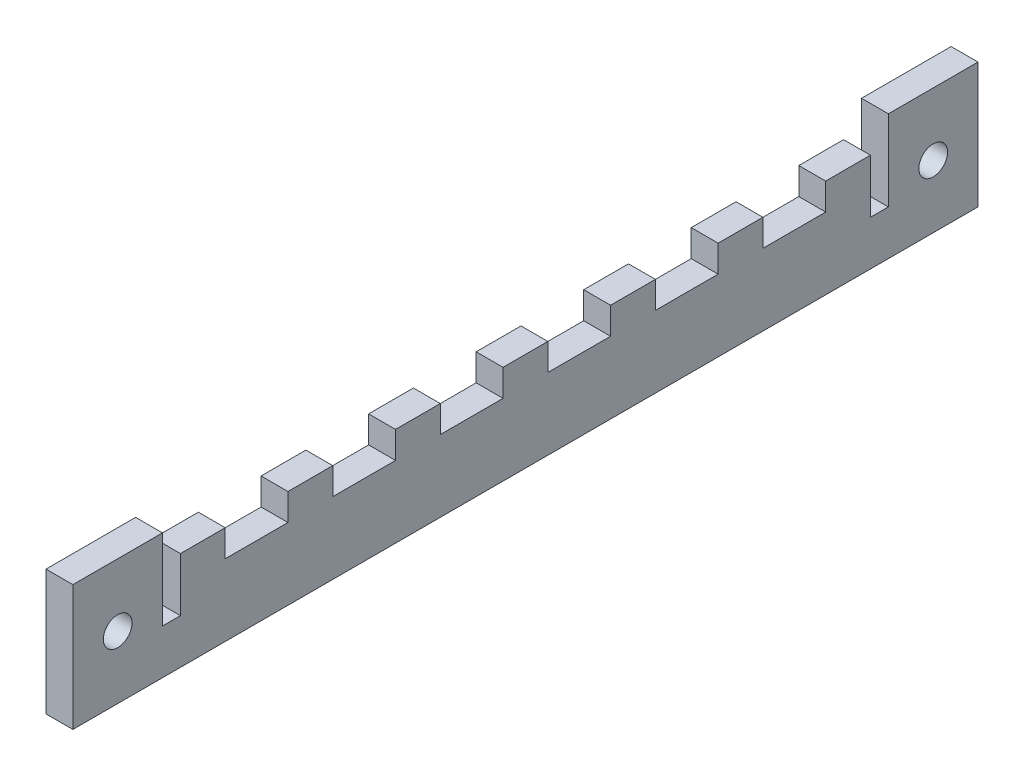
ISO-10303-21;
HEADER;
FILE_DESCRIPTION(('STEP AP214'),'2;1');
FILE_NAME('part.step','',(''),(''),'','','');
FILE_SCHEMA(('AUTOMOTIVE_DESIGN { 1 0 10303 214 1 1 1 1 }'));
ENDSEC;
DATA;
#1=APPLICATION_CONTEXT('core data for automotive mechanical design processes');
#2=APPLICATION_PROTOCOL_DEFINITION('international standard','automotive_design',2000,#1);
#3=PRODUCT_CONTEXT('',#1,'mechanical');
#4=PRODUCT('Part','Part','',(#3));
#5=PRODUCT_RELATED_PRODUCT_CATEGORY('part','',(#4));
#6=PRODUCT_DEFINITION_FORMATION('','',#4);
#7=PRODUCT_DEFINITION_CONTEXT('part definition',#1,'design');
#8=PRODUCT_DEFINITION('design','',#6,#7);
#9=PRODUCT_DEFINITION_SHAPE('','',#8);
#10=(LENGTH_UNIT() NAMED_UNIT(*) SI_UNIT(.MILLI.,.METRE.));
#11=(NAMED_UNIT(*) PLANE_ANGLE_UNIT() SI_UNIT($,.RADIAN.));
#12=(NAMED_UNIT(*) SI_UNIT($,.STERADIAN.) SOLID_ANGLE_UNIT());
#13=UNCERTAINTY_MEASURE_WITH_UNIT(LENGTH_MEASURE(1.E-05),#10,'distance_accuracy_value','');
#14=(GEOMETRIC_REPRESENTATION_CONTEXT(3) GLOBAL_UNCERTAINTY_ASSIGNED_CONTEXT((#13)) GLOBAL_UNIT_ASSIGNED_CONTEXT((#10,
#11,#12)) REPRESENTATION_CONTEXT('',''));
#15=CARTESIAN_POINT('',(0.,0.,0.));
#16=DIRECTION('',(0.,0.,1.));
#17=DIRECTION('',(1.,0.,0.));
#18=AXIS2_PLACEMENT_3D('',#15,#16,#17);
#19=CARTESIAN_POINT('',(25.5,24.4814087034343,-50.51));
#20=DIRECTION('',(-1.,0.,0.));
#21=DIRECTION('',(0.,0.,1.));
#22=AXIS2_PLACEMENT_3D('',#19,#20,#21);
#23=PLANE('',#22);
#24=CARTESIAN_POINT('',(25.5,7.,45.5));
#25=DIRECTION('',(-1.,0.,0.));
#26=DIRECTION('',(0.,0.,1.));
#27=AXIS2_PLACEMENT_3D('',#24,#25,#26);
#28=CIRCLE('',#27,1.6);
#29=CARTESIAN_POINT('',(25.5,7.,47.1));
#30=VERTEX_POINT('',#29);
#31=EDGE_CURVE('E282',#30,#30,#28,.F.);
#32=ORIENTED_EDGE('',*,*,#31,.F.);
#33=EDGE_LOOP('',(#32));
#34=FACE_BOUND('',#33,.T.);
#35=DIRECTION('',(0.,0.,-1.));
#36=VECTOR('',#35,1.);
#37=CARTESIAN_POINT('',(25.5,0.,0.));
#38=LINE('',#37,#36);
#39=CARTESIAN_POINT('',(25.5,0.,50.5));
#40=VERTEX_POINT('',#39);
#41=CARTESIAN_POINT('',(25.5,0.,-50.5));
#42=VERTEX_POINT('',#41);
#43=EDGE_CURVE('E302',#40,#42,#38,.T.);
#44=ORIENTED_EDGE('',*,*,#43,.T.);
#45=DIRECTION('',(0.,-1.,0.));
#46=VECTOR('',#45,1.);
#47=CARTESIAN_POINT('',(25.5,14.,-50.5));
#48=LINE('',#47,#46);
#49=CARTESIAN_POINT('',(25.5,14.,-50.5));
#50=VERTEX_POINT('',#49);
#51=EDGE_CURVE('E311',#50,#42,#48,.T.);
#52=ORIENTED_EDGE('',*,*,#51,.F.);
#53=DIRECTION('',(0.,0.,-1.));
#54=VECTOR('',#53,1.);
#55=CARTESIAN_POINT('',(25.5,14.,0.));
#56=LINE('',#55,#54);
#57=CARTESIAN_POINT('',(25.5,14.,-40.5));
#58=VERTEX_POINT('',#57);
#59=EDGE_CURVE('E307',#58,#50,#56,.T.);
#60=ORIENTED_EDGE('',*,*,#59,.F.);
#61=DIRECTION('',(0.,-1.,0.));
#62=VECTOR('',#61,1.);
#63=CARTESIAN_POINT('',(25.5,-4.,-40.5));
#64=LINE('',#63,#62);
#65=CARTESIAN_POINT('',(25.5,5.,-40.5));
#66=VERTEX_POINT('',#65);
#67=EDGE_CURVE('E275',#58,#66,#64,.T.);
#68=ORIENTED_EDGE('',*,*,#67,.T.);
#69=DIRECTION('',(0.,0.,-1.));
#70=VECTOR('',#69,1.);
#71=CARTESIAN_POINT('',(25.5,5.,-40.5));
#72=LINE('',#71,#70);
#73=CARTESIAN_POINT('',(25.5,5.,-38.5));
#74=VERTEX_POINT('',#73);
#75=EDGE_CURVE('E57',#74,#66,#72,.T.);
#76=ORIENTED_EDGE('',*,*,#75,.F.);
#77=DIRECTION('',(0.,-1.,0.));
#78=VECTOR('',#77,1.);
#79=CARTESIAN_POINT('',(25.5,11.,-38.5));
#80=LINE('',#79,#78);
#81=CARTESIAN_POINT('',(25.5,11.,-38.5));
#82=VERTEX_POINT('',#81);
#83=EDGE_CURVE('E583',#82,#74,#80,.T.);
#84=ORIENTED_EDGE('',*,*,#83,.F.);
#85=DIRECTION('',(0.,0.,1.));
#86=VECTOR('',#85,1.);
#87=CARTESIAN_POINT('',(25.5,11.,-38.5));
#88=LINE('',#87,#86);
#89=CARTESIAN_POINT('',(25.5,11.,-33.5));
#90=VERTEX_POINT('',#89);
#91=EDGE_CURVE('E329',#82,#90,#88,.T.);
#92=ORIENTED_EDGE('',*,*,#91,.T.);
#93=DIRECTION('',(0.,-1.,0.));
#94=VECTOR('',#93,1.);
#95=CARTESIAN_POINT('',(25.5,11.,-33.5));
#96=LINE('',#95,#94);
#97=CARTESIAN_POINT('',(25.5,8.,-33.5));
#98=VERTEX_POINT('',#97);
#99=EDGE_CURVE('E326',#90,#98,#96,.T.);
#100=ORIENTED_EDGE('',*,*,#99,.T.);
#101=DIRECTION('',(0.,0.,1.));
#102=VECTOR('',#101,1.);
#103=CARTESIAN_POINT('',(25.5,8.,-38.5));
#104=LINE('',#103,#102);
#105=CARTESIAN_POINT('',(25.5,8.,-26.5));
#106=VERTEX_POINT('',#105);
#107=EDGE_CURVE('E592',#98,#106,#104,.T.);
#108=ORIENTED_EDGE('',*,*,#107,.T.);
#109=DIRECTION('',(0.,-1.,0.));
#110=VECTOR('',#109,1.);
#111=CARTESIAN_POINT('',(25.5,11.,-26.5));
#112=LINE('',#111,#110);
#113=CARTESIAN_POINT('',(25.5,11.,-26.5));
#114=VERTEX_POINT('',#113);
#115=EDGE_CURVE('E577',#114,#106,#112,.T.);
#116=ORIENTED_EDGE('',*,*,#115,.F.);
#117=DIRECTION('',(0.,0.,1.));
#118=VECTOR('',#117,1.);
#119=CARTESIAN_POINT('',(25.5,11.,-26.5));
#120=LINE('',#119,#118);
#121=CARTESIAN_POINT('',(25.5,11.,-21.5));
#122=VERTEX_POINT('',#121);
#123=EDGE_CURVE('E333',#114,#122,#120,.T.);
#124=ORIENTED_EDGE('',*,*,#123,.T.);
#125=DIRECTION('',(0.,-1.,0.));
#126=VECTOR('',#125,1.);
#127=CARTESIAN_POINT('',(25.5,11.,-21.5));
#128=LINE('',#127,#126);
#129=CARTESIAN_POINT('',(25.5,8.,-21.5));
#130=VERTEX_POINT('',#129);
#131=EDGE_CURVE('E330',#122,#130,#128,.T.);
#132=ORIENTED_EDGE('',*,*,#131,.T.);
#133=CARTESIAN_POINT('',(25.5,8.,-14.5));
#134=VERTEX_POINT('',#133);
#135=EDGE_CURVE('E987',#130,#134,#104,.T.);
#136=ORIENTED_EDGE('',*,*,#135,.T.);
#137=DIRECTION('',(0.,-1.,0.));
#138=VECTOR('',#137,1.);
#139=CARTESIAN_POINT('',(25.5,11.,-14.5));
#140=LINE('',#139,#138);
#141=CARTESIAN_POINT('',(25.5,11.,-14.5));
#142=VERTEX_POINT('',#141);
#143=EDGE_CURVE('E571',#142,#134,#140,.T.);
#144=ORIENTED_EDGE('',*,*,#143,.F.);
#145=DIRECTION('',(0.,0.,1.));
#146=VECTOR('',#145,1.);
#147=CARTESIAN_POINT('',(25.5,11.,-14.5));
#148=LINE('',#147,#146);
#149=CARTESIAN_POINT('',(25.5,11.,-9.5));
#150=VERTEX_POINT('',#149);
#151=EDGE_CURVE('E337',#142,#150,#148,.T.);
#152=ORIENTED_EDGE('',*,*,#151,.T.);
#153=DIRECTION('',(0.,-1.,0.));
#154=VECTOR('',#153,1.);
#155=CARTESIAN_POINT('',(25.5,11.,-9.5));
#156=LINE('',#155,#154);
#157=CARTESIAN_POINT('',(25.5,8.,-9.5));
#158=VERTEX_POINT('',#157);
#159=EDGE_CURVE('E334',#150,#158,#156,.T.);
#160=ORIENTED_EDGE('',*,*,#159,.T.);
#161=CARTESIAN_POINT('',(25.5,8.,-2.49999999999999));
#162=VERTEX_POINT('',#161);
#163=EDGE_CURVE('E996',#158,#162,#104,.T.);
#164=ORIENTED_EDGE('',*,*,#163,.T.);
#165=DIRECTION('',(0.,-1.,0.));
#166=VECTOR('',#165,1.);
#167=CARTESIAN_POINT('',(25.5,11.,-2.49999999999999));
#168=LINE('',#167,#166);
#169=CARTESIAN_POINT('',(25.5,11.,-2.49999999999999));
#170=VERTEX_POINT('',#169);
#171=EDGE_CURVE('E565',#170,#162,#168,.T.);
#172=ORIENTED_EDGE('',*,*,#171,.F.);
#173=DIRECTION('',(0.,0.,1.));
#174=VECTOR('',#173,1.);
#175=CARTESIAN_POINT('',(25.5,11.,-2.49999999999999));
#176=LINE('',#175,#174);
#177=CARTESIAN_POINT('',(25.5,11.,2.5));
#178=VERTEX_POINT('',#177);
#179=EDGE_CURVE('E341',#170,#178,#176,.T.);
#180=ORIENTED_EDGE('',*,*,#179,.T.);
#181=DIRECTION('',(0.,-1.,0.));
#182=VECTOR('',#181,1.);
#183=CARTESIAN_POINT('',(25.5,11.,2.5));
#184=LINE('',#183,#182);
#185=CARTESIAN_POINT('',(25.5,8.,2.5));
#186=VERTEX_POINT('',#185);
#187=EDGE_CURVE('E338',#178,#186,#184,.T.);
#188=ORIENTED_EDGE('',*,*,#187,.T.);
#189=CARTESIAN_POINT('',(25.5,8.,9.50000000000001));
#190=VERTEX_POINT('',#189);
#191=EDGE_CURVE('E998',#186,#190,#104,.T.);
#192=ORIENTED_EDGE('',*,*,#191,.T.);
#193=DIRECTION('',(0.,-1.,0.));
#194=VECTOR('',#193,1.);
#195=CARTESIAN_POINT('',(25.5,11.,9.50000000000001));
#196=LINE('',#195,#194);
#197=CARTESIAN_POINT('',(25.5,11.,9.50000000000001));
#198=VERTEX_POINT('',#197);
#199=EDGE_CURVE('E559',#198,#190,#196,.T.);
#200=ORIENTED_EDGE('',*,*,#199,.F.);
#201=DIRECTION('',(0.,0.,1.));
#202=VECTOR('',#201,1.);
#203=CARTESIAN_POINT('',(25.5,11.,9.50000000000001));
#204=LINE('',#203,#202);
#205=CARTESIAN_POINT('',(25.5,11.,14.5));
#206=VERTEX_POINT('',#205);
#207=EDGE_CURVE('E345',#198,#206,#204,.T.);
#208=ORIENTED_EDGE('',*,*,#207,.T.);
#209=DIRECTION('',(0.,-1.,0.));
#210=VECTOR('',#209,1.);
#211=CARTESIAN_POINT('',(25.5,11.,14.5));
#212=LINE('',#211,#210);
#213=CARTESIAN_POINT('',(25.5,8.,14.5));
#214=VERTEX_POINT('',#213);
#215=EDGE_CURVE('E342',#206,#214,#212,.T.);
#216=ORIENTED_EDGE('',*,*,#215,.T.);
#217=CARTESIAN_POINT('',(25.5,8.,21.5));
#218=VERTEX_POINT('',#217);
#219=EDGE_CURVE('E591',#214,#218,#104,.T.);
#220=ORIENTED_EDGE('',*,*,#219,.T.);
#221=DIRECTION('',(0.,-1.,0.));
#222=VECTOR('',#221,1.);
#223=CARTESIAN_POINT('',(25.5,11.,21.5));
#224=LINE('',#223,#222);
#225=CARTESIAN_POINT('',(25.5,11.,21.5));
#226=VERTEX_POINT('',#225);
#227=EDGE_CURVE('E553',#226,#218,#224,.T.);
#228=ORIENTED_EDGE('',*,*,#227,.F.);
#229=DIRECTION('',(0.,0.,1.));
#230=VECTOR('',#229,1.);
#231=CARTESIAN_POINT('',(25.5,11.,21.5));
#232=LINE('',#231,#230);
#233=CARTESIAN_POINT('',(25.5,11.,26.5));
#234=VERTEX_POINT('',#233);
#235=EDGE_CURVE('E349',#226,#234,#232,.T.);
#236=ORIENTED_EDGE('',*,*,#235,.T.);
#237=DIRECTION('',(0.,-1.,0.));
#238=VECTOR('',#237,1.);
#239=CARTESIAN_POINT('',(25.5,11.,26.5));
#240=LINE('',#239,#238);
#241=CARTESIAN_POINT('',(25.5,8.,26.5));
#242=VERTEX_POINT('',#241);
#243=EDGE_CURVE('E346',#234,#242,#240,.T.);
#244=ORIENTED_EDGE('',*,*,#243,.T.);
#245=CARTESIAN_POINT('',(25.5,8.,33.5));
#246=VERTEX_POINT('',#245);
#247=EDGE_CURVE('E357',#242,#246,#104,.T.);
#248=ORIENTED_EDGE('',*,*,#247,.T.);
#249=DIRECTION('',(0.,-1.,0.));
#250=VECTOR('',#249,1.);
#251=CARTESIAN_POINT('',(25.5,11.,33.5));
#252=LINE('',#251,#250);
#253=CARTESIAN_POINT('',(25.5,11.,33.5));
#254=VERTEX_POINT('',#253);
#255=EDGE_CURVE('E548',#254,#246,#252,.T.);
#256=ORIENTED_EDGE('',*,*,#255,.F.);
#257=DIRECTION('',(0.,0.,1.));
#258=VECTOR('',#257,1.);
#259=CARTESIAN_POINT('',(25.5,11.,33.5));
#260=LINE('',#259,#258);
#261=CARTESIAN_POINT('',(25.5,11.,38.5));
#262=VERTEX_POINT('',#261);
#263=EDGE_CURVE('E352',#254,#262,#260,.T.);
#264=ORIENTED_EDGE('',*,*,#263,.T.);
#265=DIRECTION('',(0.,-1.,0.));
#266=VECTOR('',#265,1.);
#267=CARTESIAN_POINT('',(25.5,11.,38.5));
#268=LINE('',#267,#266);
#269=CARTESIAN_POINT('',(25.5,5.,38.5));
#270=VERTEX_POINT('',#269);
#271=EDGE_CURVE('E281',#262,#270,#268,.T.);
#272=ORIENTED_EDGE('',*,*,#271,.T.);
#273=CARTESIAN_POINT('',(25.5,5.,40.5));
#274=VERTEX_POINT('',#273);
#275=EDGE_CURVE('E49',#274,#270,#72,.T.);
#276=ORIENTED_EDGE('',*,*,#275,.F.);
#277=DIRECTION('',(0.,1.,0.));
#278=VECTOR('',#277,1.);
#279=CARTESIAN_POINT('',(25.5,-4.,40.5));
#280=LINE('',#279,#278);
#281=CARTESIAN_POINT('',(25.5,14.,40.5));
#282=VERTEX_POINT('',#281);
#283=EDGE_CURVE('E270',#274,#282,#280,.T.);
#284=ORIENTED_EDGE('',*,*,#283,.T.);
#285=CARTESIAN_POINT('',(25.5,14.,50.5));
#286=VERTEX_POINT('',#285);
#287=EDGE_CURVE('E305',#286,#282,#56,.T.);
#288=ORIENTED_EDGE('',*,*,#287,.F.);
#289=DIRECTION('',(0.,1.,0.));
#290=VECTOR('',#289,1.);
#291=CARTESIAN_POINT('',(25.5,14.,50.5));
#292=LINE('',#291,#290);
#293=EDGE_CURVE('E309',#40,#286,#292,.T.);
#294=ORIENTED_EDGE('',*,*,#293,.F.);
#295=EDGE_LOOP('',(#44,#52,#60,#68,#76,#84,#92,#100,#108,#116,#124,#132,#136,#144,#152,#160,
#164,#172,#180,#188,#192,#200,#208,#216,#220,#228,#236,#244,#248,#256,#264,#272,#276,#284,#288,#294));
#296=FACE_BOUND('',#295,.T.);
#297=CARTESIAN_POINT('',(25.5,7.,-45.5));
#298=DIRECTION('',(-1.,0.,0.));
#299=DIRECTION('',(0.,0.,1.));
#300=AXIS2_PLACEMENT_3D('',#297,#298,#299);
#301=CIRCLE('',#300,1.6);
#302=CARTESIAN_POINT('',(25.5,7.,-43.9));
#303=VERTEX_POINT('',#302);
#304=EDGE_CURVE('E314',#303,#303,#301,.F.);
#305=ORIENTED_EDGE('',*,*,#304,.F.);
#306=EDGE_LOOP('',(#305));
#307=FACE_BOUND('',#306,.T.);
#308=ADVANCED_FACE('F32',(#34,#296,#307),#23,.F.);
#309=CARTESIAN_POINT('',(22.5,24.4814087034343,-50.51));
#310=DIRECTION('',(-1.,0.,0.));
#311=DIRECTION('',(0.,0.,1.));
#312=AXIS2_PLACEMENT_3D('',#309,#310,#311);
#313=PLANE('',#312);
#314=CARTESIAN_POINT('',(22.5,7.,-45.5));
#315=DIRECTION('',(-1.,0.,0.));
#316=DIRECTION('',(0.,0.,1.));
#317=AXIS2_PLACEMENT_3D('',#314,#315,#316);
#318=CIRCLE('',#317,1.6);
#319=CARTESIAN_POINT('',(22.5,7.,-43.9));
#320=VERTEX_POINT('',#319);
#321=EDGE_CURVE('E293',#320,#320,#318,.F.);
#322=ORIENTED_EDGE('',*,*,#321,.T.);
#323=EDGE_LOOP('',(#322));
#324=FACE_BOUND('',#323,.T.);
#325=DIRECTION('',(0.,1.,0.));
#326=VECTOR('',#325,1.);
#327=CARTESIAN_POINT('',(22.5,14.,50.5));
#328=LINE('',#327,#326);
#329=CARTESIAN_POINT('',(22.5,0.,50.5));
#330=VERTEX_POINT('',#329);
#331=CARTESIAN_POINT('',(22.5,14.,50.5));
#332=VERTEX_POINT('',#331);
#333=EDGE_CURVE('E370',#330,#332,#328,.T.);
#334=ORIENTED_EDGE('',*,*,#333,.T.);
#335=DIRECTION('',(0.,0.,-1.));
#336=VECTOR('',#335,1.);
#337=CARTESIAN_POINT('',(22.5,14.,0.));
#338=LINE('',#337,#336);
#339=CARTESIAN_POINT('',(22.5,14.,40.5));
#340=VERTEX_POINT('',#339);
#341=EDGE_CURVE('E308',#332,#340,#338,.T.);
#342=ORIENTED_EDGE('',*,*,#341,.T.);
#343=DIRECTION('',(0.,1.,0.));
#344=VECTOR('',#343,1.);
#345=CARTESIAN_POINT('',(22.5,-4.,40.5));
#346=LINE('',#345,#344);
#347=CARTESIAN_POINT('',(22.5,5.,40.5));
#348=VERTEX_POINT('',#347);
#349=EDGE_CURVE('E540',#348,#340,#346,.T.);
#350=ORIENTED_EDGE('',*,*,#349,.F.);
#351=DIRECTION('',(0.,0.,-1.));
#352=VECTOR('',#351,1.);
#353=CARTESIAN_POINT('',(22.5,5.,-40.5));
#354=LINE('',#353,#352);
#355=CARTESIAN_POINT('',(22.5,5.,38.5));
#356=VERTEX_POINT('',#355);
#357=EDGE_CURVE('E287',#348,#356,#354,.T.);
#358=ORIENTED_EDGE('',*,*,#357,.T.);
#359=DIRECTION('',(0.,-1.,0.));
#360=VECTOR('',#359,1.);
#361=CARTESIAN_POINT('',(22.5,11.,38.5));
#362=LINE('',#361,#360);
#363=CARTESIAN_POINT('',(22.5,11.,38.5));
#364=VERTEX_POINT('',#363);
#365=EDGE_CURVE('E1017',#364,#356,#362,.T.);
#366=ORIENTED_EDGE('',*,*,#365,.F.);
#367=DIRECTION('',(0.,0.,1.));
#368=VECTOR('',#367,1.);
#369=CARTESIAN_POINT('',(22.5,11.,31.5));
#370=LINE('',#369,#368);
#371=CARTESIAN_POINT('',(22.5,11.,33.5));
#372=VERTEX_POINT('',#371);
#373=EDGE_CURVE('E1016',#372,#364,#370,.T.);
#374=ORIENTED_EDGE('',*,*,#373,.F.);
#375=DIRECTION('',(0.,1.,0.));
#376=VECTOR('',#375,1.);
#377=CARTESIAN_POINT('',(22.5,11.,33.5));
#378=LINE('',#377,#376);
#379=CARTESIAN_POINT('',(22.5,8.,33.5));
#380=VERTEX_POINT('',#379);
#381=EDGE_CURVE('E965',#380,#372,#378,.T.);
#382=ORIENTED_EDGE('',*,*,#381,.F.);
#383=DIRECTION('',(0.,0.,-1.));
#384=VECTOR('',#383,1.);
#385=CARTESIAN_POINT('',(22.5,8.,-38.5));
#386=LINE('',#385,#384);
#387=CARTESIAN_POINT('',(22.5,8.,26.5));
#388=VERTEX_POINT('',#387);
#389=EDGE_CURVE('E597',#380,#388,#386,.T.);
#390=ORIENTED_EDGE('',*,*,#389,.T.);
#391=DIRECTION('',(0.,-1.,0.));
#392=VECTOR('',#391,1.);
#393=CARTESIAN_POINT('',(22.5,11.,26.5));
#394=LINE('',#393,#392);
#395=CARTESIAN_POINT('',(22.5,11.,26.5));
#396=VERTEX_POINT('',#395);
#397=EDGE_CURVE('E960',#396,#388,#394,.T.);
#398=ORIENTED_EDGE('',*,*,#397,.F.);
#399=DIRECTION('',(0.,0.,1.));
#400=VECTOR('',#399,1.);
#401=CARTESIAN_POINT('',(22.5,11.,19.5));
#402=LINE('',#401,#400);
#403=CARTESIAN_POINT('',(22.5,11.,21.5));
#404=VERTEX_POINT('',#403);
#405=EDGE_CURVE('E1011',#404,#396,#402,.T.);
#406=ORIENTED_EDGE('',*,*,#405,.F.);
#407=DIRECTION('',(0.,1.,0.));
#408=VECTOR('',#407,1.);
#409=CARTESIAN_POINT('',(22.5,11.,21.5));
#410=LINE('',#409,#408);
#411=CARTESIAN_POINT('',(22.5,8.,21.5));
#412=VERTEX_POINT('',#411);
#413=EDGE_CURVE('E962',#412,#404,#410,.T.);
#414=ORIENTED_EDGE('',*,*,#413,.F.);
#415=CARTESIAN_POINT('',(22.5,8.,14.5));
#416=VERTEX_POINT('',#415);
#417=EDGE_CURVE('E966',#412,#416,#386,.T.);
#418=ORIENTED_EDGE('',*,*,#417,.T.);
#419=DIRECTION('',(0.,-1.,0.));
#420=VECTOR('',#419,1.);
#421=CARTESIAN_POINT('',(22.5,11.,14.5));
#422=LINE('',#421,#420);
#423=CARTESIAN_POINT('',(22.5,11.,14.5));
#424=VERTEX_POINT('',#423);
#425=EDGE_CURVE('E1026',#424,#416,#422,.T.);
#426=ORIENTED_EDGE('',*,*,#425,.F.);
#427=DIRECTION('',(0.,0.,1.));
#428=VECTOR('',#427,1.);
#429=CARTESIAN_POINT('',(22.5,11.,7.50000000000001));
#430=LINE('',#429,#428);
#431=CARTESIAN_POINT('',(22.5,11.,9.50000000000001));
#432=VERTEX_POINT('',#431);
#433=EDGE_CURVE('E1024',#432,#424,#430,.T.);
#434=ORIENTED_EDGE('',*,*,#433,.F.);
#435=DIRECTION('',(0.,1.,0.));
#436=VECTOR('',#435,1.);
#437=CARTESIAN_POINT('',(22.5,11.,9.50000000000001));
#438=LINE('',#437,#436);
#439=CARTESIAN_POINT('',(22.5,8.,9.50000000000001));
#440=VERTEX_POINT('',#439);
#441=EDGE_CURVE('E961',#440,#432,#438,.T.);
#442=ORIENTED_EDGE('',*,*,#441,.F.);
#443=CARTESIAN_POINT('',(22.5,8.,2.5));
#444=VERTEX_POINT('',#443);
#445=EDGE_CURVE('E968',#440,#444,#386,.T.);
#446=ORIENTED_EDGE('',*,*,#445,.T.);
#447=DIRECTION('',(0.,-1.,0.));
#448=VECTOR('',#447,1.);
#449=CARTESIAN_POINT('',(22.5,11.,2.5));
#450=LINE('',#449,#448);
#451=CARTESIAN_POINT('',(22.5,11.,2.5));
#452=VERTEX_POINT('',#451);
#453=EDGE_CURVE('E531',#452,#444,#450,.T.);
#454=ORIENTED_EDGE('',*,*,#453,.F.);
#455=DIRECTION('',(0.,0.,1.));
#456=VECTOR('',#455,1.);
#457=CARTESIAN_POINT('',(22.5,11.,-4.49999999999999));
#458=LINE('',#457,#456);
#459=CARTESIAN_POINT('',(22.5,11.,-2.49999999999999));
#460=VERTEX_POINT('',#459);
#461=EDGE_CURVE('E1030',#460,#452,#458,.T.);
#462=ORIENTED_EDGE('',*,*,#461,.F.);
#463=DIRECTION('',(0.,1.,0.));
#464=VECTOR('',#463,1.);
#465=CARTESIAN_POINT('',(22.5,11.,-2.49999999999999));
#466=LINE('',#465,#464);
#467=CARTESIAN_POINT('',(22.5,8.,-2.49999999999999));
#468=VERTEX_POINT('',#467);
#469=EDGE_CURVE('E1028',#468,#460,#466,.T.);
#470=ORIENTED_EDGE('',*,*,#469,.F.);
#471=CARTESIAN_POINT('',(22.5,8.,-9.5));
#472=VERTEX_POINT('',#471);
#473=EDGE_CURVE('E973',#468,#472,#386,.T.);
#474=ORIENTED_EDGE('',*,*,#473,.T.);
#475=DIRECTION('',(0.,-1.,0.));
#476=VECTOR('',#475,1.);
#477=CARTESIAN_POINT('',(22.5,11.,-9.5));
#478=LINE('',#477,#476);
#479=CARTESIAN_POINT('',(22.5,11.,-9.5));
#480=VERTEX_POINT('',#479);
#481=EDGE_CURVE('E530',#480,#472,#478,.T.);
#482=ORIENTED_EDGE('',*,*,#481,.F.);
#483=DIRECTION('',(0.,0.,1.));
#484=VECTOR('',#483,1.);
#485=CARTESIAN_POINT('',(22.5,11.,-16.5));
#486=LINE('',#485,#484);
#487=CARTESIAN_POINT('',(22.5,11.,-14.5));
#488=VERTEX_POINT('',#487);
#489=EDGE_CURVE('E525',#488,#480,#486,.T.);
#490=ORIENTED_EDGE('',*,*,#489,.F.);
#491=DIRECTION('',(0.,1.,0.));
#492=VECTOR('',#491,1.);
#493=CARTESIAN_POINT('',(22.5,11.,-14.5));
#494=LINE('',#493,#492);
#495=CARTESIAN_POINT('',(22.5,8.,-14.5));
#496=VERTEX_POINT('',#495);
#497=EDGE_CURVE('E527',#496,#488,#494,.T.);
#498=ORIENTED_EDGE('',*,*,#497,.F.);
#499=CARTESIAN_POINT('',(22.5,8.,-21.5));
#500=VERTEX_POINT('',#499);
#501=EDGE_CURVE('E596',#496,#500,#386,.T.);
#502=ORIENTED_EDGE('',*,*,#501,.T.);
#503=DIRECTION('',(0.,-1.,0.));
#504=VECTOR('',#503,1.);
#505=CARTESIAN_POINT('',(22.5,11.,-21.5));
#506=LINE('',#505,#504);
#507=CARTESIAN_POINT('',(22.5,11.,-21.5));
#508=VERTEX_POINT('',#507);
#509=EDGE_CURVE('E532',#508,#500,#506,.T.);
#510=ORIENTED_EDGE('',*,*,#509,.F.);
#511=DIRECTION('',(0.,0.,1.));
#512=VECTOR('',#511,1.);
#513=CARTESIAN_POINT('',(22.5,11.,-28.5));
#514=LINE('',#513,#512);
#515=CARTESIAN_POINT('',(22.5,11.,-26.5));
#516=VERTEX_POINT('',#515);
#517=EDGE_CURVE('E536',#516,#508,#514,.T.);
#518=ORIENTED_EDGE('',*,*,#517,.F.);
#519=DIRECTION('',(0.,1.,0.));
#520=VECTOR('',#519,1.);
#521=CARTESIAN_POINT('',(22.5,11.,-26.5));
#522=LINE('',#521,#520);
#523=CARTESIAN_POINT('',(22.5,8.,-26.5));
#524=VERTEX_POINT('',#523);
#525=EDGE_CURVE('E535',#524,#516,#522,.T.);
#526=ORIENTED_EDGE('',*,*,#525,.F.);
#527=CARTESIAN_POINT('',(22.5,8.,-33.5));
#528=VERTEX_POINT('',#527);
#529=EDGE_CURVE('E593',#524,#528,#386,.T.);
#530=ORIENTED_EDGE('',*,*,#529,.T.);
#531=DIRECTION('',(0.,-1.,0.));
#532=VECTOR('',#531,1.);
#533=CARTESIAN_POINT('',(22.5,11.,-33.5));
#534=LINE('',#533,#532);
#535=CARTESIAN_POINT('',(22.5,11.,-33.5));
#536=VERTEX_POINT('',#535);
#537=EDGE_CURVE('E534',#536,#528,#534,.T.);
#538=ORIENTED_EDGE('',*,*,#537,.F.);
#539=DIRECTION('',(0.,0.,1.));
#540=VECTOR('',#539,1.);
#541=CARTESIAN_POINT('',(22.5,11.,-40.5));
#542=LINE('',#541,#540);
#543=CARTESIAN_POINT('',(22.5,11.,-38.5));
#544=VERTEX_POINT('',#543);
#545=EDGE_CURVE('E366',#544,#536,#542,.T.);
#546=ORIENTED_EDGE('',*,*,#545,.F.);
#547=DIRECTION('',(0.,1.,0.));
#548=VECTOR('',#547,1.);
#549=CARTESIAN_POINT('',(22.5,11.,-38.5));
#550=LINE('',#549,#548);
#551=CARTESIAN_POINT('',(22.5,5.,-38.5));
#552=VERTEX_POINT('',#551);
#553=EDGE_CURVE('E541',#552,#544,#550,.T.);
#554=ORIENTED_EDGE('',*,*,#553,.F.);
#555=CARTESIAN_POINT('',(22.5,5.,-40.5));
#556=VERTEX_POINT('',#555);
#557=EDGE_CURVE('E36',#552,#556,#354,.T.);
#558=ORIENTED_EDGE('',*,*,#557,.T.);
#559=DIRECTION('',(0.,-1.,0.));
#560=VECTOR('',#559,1.);
#561=CARTESIAN_POINT('',(22.5,-4.,-40.5));
#562=LINE('',#561,#560);
#563=CARTESIAN_POINT('',(22.5,14.,-40.5));
#564=VERTEX_POINT('',#563);
#565=EDGE_CURVE('E538',#564,#556,#562,.T.);
#566=ORIENTED_EDGE('',*,*,#565,.F.);
#567=CARTESIAN_POINT('',(22.5,14.,-50.5));
#568=VERTEX_POINT('',#567);
#569=EDGE_CURVE('E367',#564,#568,#338,.T.);
#570=ORIENTED_EDGE('',*,*,#569,.T.);
#571=DIRECTION('',(0.,-1.,0.));
#572=VECTOR('',#571,1.);
#573=CARTESIAN_POINT('',(22.5,14.,-50.5));
#574=LINE('',#573,#572);
#575=CARTESIAN_POINT('',(22.5,0.,-50.5));
#576=VERTEX_POINT('',#575);
#577=EDGE_CURVE('E304',#568,#576,#574,.T.);
#578=ORIENTED_EDGE('',*,*,#577,.T.);
#579=DIRECTION('',(0.,0.,-1.));
#580=VECTOR('',#579,1.);
#581=CARTESIAN_POINT('',(22.5,0.,0.));
#582=LINE('',#581,#580);
#583=EDGE_CURVE('E313',#330,#576,#582,.T.);
#584=ORIENTED_EDGE('',*,*,#583,.F.);
#585=EDGE_LOOP('',(#334,#342,#350,#358,#366,#374,#382,#390,#398,#406,#414,#418,#426,#434,#442,
#446,#454,#462,#470,#474,#482,#490,#498,#502,#510,#518,#526,#530,#538,#546,#554,#558,#566,#570,
#578,#584));
#586=FACE_BOUND('',#585,.T.);
#587=CARTESIAN_POINT('',(22.5,7.,45.5));
#588=DIRECTION('',(-1.,0.,0.));
#589=DIRECTION('',(0.,0.,1.));
#590=AXIS2_PLACEMENT_3D('',#587,#588,#589);
#591=CIRCLE('',#590,1.6);
#592=CARTESIAN_POINT('',(22.5,7.,47.1));
#593=VERTEX_POINT('',#592);
#594=EDGE_CURVE('E291',#593,#593,#591,.F.);
#595=ORIENTED_EDGE('',*,*,#594,.T.);
#596=EDGE_LOOP('',(#595));
#597=FACE_BOUND('',#596,.T.);
#598=ADVANCED_FACE('F378',(#324,#586,#597),#313,.T.);
#599=CARTESIAN_POINT('',(31.5,5.,-40.5));
#600=DIRECTION('',(0.,-1.,0.));
#601=DIRECTION('',(1.,0.,0.));
#602=AXIS2_PLACEMENT_3D('',#599,#600,#601);
#603=PLANE('',#602);
#604=ORIENTED_EDGE('',*,*,#557,.F.);
#605=DIRECTION('',(-1.,0.,0.));
#606=VECTOR('',#605,1.);
#607=CARTESIAN_POINT('',(25.5,5.,-38.5));
#608=LINE('',#607,#606);
#609=EDGE_CURVE('E320',#74,#552,#608,.T.);
#610=ORIENTED_EDGE('',*,*,#609,.F.);
#611=ORIENTED_EDGE('',*,*,#75,.T.);
#612=DIRECTION('',(1.,0.,0.));
#613=VECTOR('',#612,1.);
#614=CARTESIAN_POINT('',(31.5,5.,-40.5));
#615=LINE('',#614,#613);
#616=EDGE_CURVE('E41',#556,#66,#615,.T.);
#617=ORIENTED_EDGE('',*,*,#616,.F.);
#618=EDGE_LOOP('',(#604,#610,#611,#617));
#619=FACE_BOUND('',#618,.T.);
#620=ADVANCED_FACE('F389',(#619),#603,.F.);
#621=CARTESIAN_POINT('',(0.,14.,0.));
#622=DIRECTION('',(0.,-1.,0.));
#623=DIRECTION('',(0.,0.,-1.));
#624=AXIS2_PLACEMENT_3D('',#621,#622,#623);
#625=PLANE('',#624);
#626=ORIENTED_EDGE('',*,*,#569,.F.);
#627=DIRECTION('',(1.,0.,0.));
#628=VECTOR('',#627,1.);
#629=CARTESIAN_POINT('',(31.5,14.,-40.5));
#630=LINE('',#629,#628);
#631=EDGE_CURVE('E323',#564,#58,#630,.T.);
#632=ORIENTED_EDGE('',*,*,#631,.T.);
#633=ORIENTED_EDGE('',*,*,#59,.T.);
#634=DIRECTION('',(-1.,0.,0.));
#635=VECTOR('',#634,1.);
#636=CARTESIAN_POINT('',(-34.5,14.,-50.5));
#637=LINE('',#636,#635);
#638=EDGE_CURVE('E364',#50,#568,#637,.T.);
#639=ORIENTED_EDGE('',*,*,#638,.T.);
#640=EDGE_LOOP('',(#626,#632,#633,#639));
#641=FACE_BOUND('',#640,.T.);
#642=ADVANCED_FACE('F407',(#641),#625,.F.);
#643=CARTESIAN_POINT('',(31.5,-4.,-40.5));
#644=DIRECTION('',(0.,0.,1.));
#645=DIRECTION('',(-1.,0.,0.));
#646=AXIS2_PLACEMENT_3D('',#643,#644,#645);
#647=PLANE('',#646);
#648=ORIENTED_EDGE('',*,*,#631,.F.);
#649=ORIENTED_EDGE('',*,*,#565,.T.);
#650=ORIENTED_EDGE('',*,*,#616,.T.);
#651=ORIENTED_EDGE('',*,*,#67,.F.);
#652=EDGE_LOOP('',(#648,#649,#650,#651));
#653=FACE_BOUND('',#652,.T.);
#654=ADVANCED_FACE('F405',(#653),#647,.T.);
#655=ORIENTED_EDGE('',*,*,#341,.F.);
#656=DIRECTION('',(1.,0.,0.));
#657=VECTOR('',#656,1.);
#658=CARTESIAN_POINT('',(-34.5,14.,50.5));
#659=LINE('',#658,#657);
#660=EDGE_CURVE('E361',#332,#286,#659,.T.);
#661=ORIENTED_EDGE('',*,*,#660,.T.);
#662=ORIENTED_EDGE('',*,*,#287,.T.);
#663=DIRECTION('',(-1.,0.,0.));
#664=VECTOR('',#663,1.);
#665=CARTESIAN_POINT('',(1.49999999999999,14.,40.5));
#666=LINE('',#665,#664);
#667=EDGE_CURVE('E273',#282,#340,#666,.T.);
#668=ORIENTED_EDGE('',*,*,#667,.T.);
#669=EDGE_LOOP('',(#655,#661,#662,#668));
#670=FACE_BOUND('',#669,.T.);
#671=ADVANCED_FACE('F402',(#670),#625,.F.);
#672=ORIENTED_EDGE('',*,*,#357,.F.);
#673=DIRECTION('',(-1.,0.,0.));
#674=VECTOR('',#673,1.);
#675=CARTESIAN_POINT('',(1.49999999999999,5.,40.5));
#676=LINE('',#675,#674);
#677=EDGE_CURVE('E11',#274,#348,#676,.T.);
#678=ORIENTED_EDGE('',*,*,#677,.F.);
#679=ORIENTED_EDGE('',*,*,#275,.T.);
#680=DIRECTION('',(1.,0.,0.));
#681=VECTOR('',#680,1.);
#682=CARTESIAN_POINT('',(25.5,5.,38.5));
#683=LINE('',#682,#681);
#684=EDGE_CURVE('E288',#356,#270,#683,.T.);
#685=ORIENTED_EDGE('',*,*,#684,.F.);
#686=EDGE_LOOP('',(#672,#678,#679,#685));
#687=FACE_BOUND('',#686,.T.);
#688=ADVANCED_FACE('F285',(#687),#603,.F.);
#689=CARTESIAN_POINT('',(1.49999999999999,-4.,40.5));
#690=DIRECTION('',(0.,0.,-1.));
#691=DIRECTION('',(1.,0.,0.));
#692=AXIS2_PLACEMENT_3D('',#689,#690,#691);
#693=PLANE('',#692);
#694=ORIENTED_EDGE('',*,*,#677,.T.);
#695=ORIENTED_EDGE('',*,*,#349,.T.);
#696=ORIENTED_EDGE('',*,*,#667,.F.);
#697=ORIENTED_EDGE('',*,*,#283,.F.);
#698=EDGE_LOOP('',(#694,#695,#696,#697));
#699=FACE_BOUND('',#698,.T.);
#700=ADVANCED_FACE('F271',(#699),#693,.T.);
#701=CARTESIAN_POINT('',(25.5,11.,38.5));
#702=DIRECTION('',(0.,0.,1.));
#703=DIRECTION('',(-1.,0.,0.));
#704=AXIS2_PLACEMENT_3D('',#701,#702,#703);
#705=PLANE('',#704);
#706=DIRECTION('',(-1.,0.,0.));
#707=VECTOR('',#706,1.);
#708=CARTESIAN_POINT('',(25.5,11.,38.5));
#709=LINE('',#708,#707);
#710=EDGE_CURVE('E551',#262,#364,#709,.T.);
#711=ORIENTED_EDGE('',*,*,#710,.T.);
#712=ORIENTED_EDGE('',*,*,#365,.T.);
#713=ORIENTED_EDGE('',*,*,#684,.T.);
#714=ORIENTED_EDGE('',*,*,#271,.F.);
#715=EDGE_LOOP('',(#711,#712,#713,#714));
#716=FACE_BOUND('',#715,.T.);
#717=ADVANCED_FACE('F413',(#716),#705,.T.);
#718=CARTESIAN_POINT('',(25.5,11.,33.5));
#719=DIRECTION('',(0.,0.,-1.));
#720=DIRECTION('',(1.,0.,0.));
#721=AXIS2_PLACEMENT_3D('',#718,#719,#720);
#722=PLANE('',#721);
#723=DIRECTION('',(-1.,0.,0.));
#724=VECTOR('',#723,1.);
#725=CARTESIAN_POINT('',(25.5,8.,33.5));
#726=LINE('',#725,#724);
#727=EDGE_CURVE('E598',#246,#380,#726,.T.);
#728=ORIENTED_EDGE('',*,*,#727,.T.);
#729=ORIENTED_EDGE('',*,*,#381,.T.);
#730=DIRECTION('',(1.,0.,0.));
#731=VECTOR('',#730,1.);
#732=CARTESIAN_POINT('',(25.5,11.,33.5));
#733=LINE('',#732,#731);
#734=EDGE_CURVE('E350',#372,#254,#733,.T.);
#735=ORIENTED_EDGE('',*,*,#734,.T.);
#736=ORIENTED_EDGE('',*,*,#255,.T.);
#737=EDGE_LOOP('',(#728,#729,#735,#736));
#738=FACE_BOUND('',#737,.T.);
#739=ADVANCED_FACE('F416',(#738),#722,.T.);
#740=CARTESIAN_POINT('',(25.5,11.,26.5));
#741=DIRECTION('',(0.,0.,1.));
#742=DIRECTION('',(-1.,0.,0.));
#743=AXIS2_PLACEMENT_3D('',#740,#741,#742);
#744=PLANE('',#743);
#745=DIRECTION('',(-1.,0.,0.));
#746=VECTOR('',#745,1.);
#747=CARTESIAN_POINT('',(25.5,11.,26.5));
#748=LINE('',#747,#746);
#749=EDGE_CURVE('E556',#234,#396,#748,.T.);
#750=ORIENTED_EDGE('',*,*,#749,.T.);
#751=ORIENTED_EDGE('',*,*,#397,.T.);
#752=DIRECTION('',(1.,0.,0.));
#753=VECTOR('',#752,1.);
#754=CARTESIAN_POINT('',(25.5,8.,26.5));
#755=LINE('',#754,#753);
#756=EDGE_CURVE('E601',#388,#242,#755,.T.);
#757=ORIENTED_EDGE('',*,*,#756,.T.);
#758=ORIENTED_EDGE('',*,*,#243,.F.);
#759=EDGE_LOOP('',(#750,#751,#757,#758));
#760=FACE_BOUND('',#759,.T.);
#761=ADVANCED_FACE('F420',(#760),#744,.T.);
#762=CARTESIAN_POINT('',(25.5,11.,21.5));
#763=DIRECTION('',(0.,0.,-1.));
#764=DIRECTION('',(1.,0.,0.));
#765=AXIS2_PLACEMENT_3D('',#762,#763,#764);
#766=PLANE('',#765);
#767=DIRECTION('',(-1.,0.,0.));
#768=VECTOR('',#767,1.);
#769=CARTESIAN_POINT('',(25.5,8.,21.5));
#770=LINE('',#769,#768);
#771=EDGE_CURVE('E603',#218,#412,#770,.T.);
#772=ORIENTED_EDGE('',*,*,#771,.T.);
#773=ORIENTED_EDGE('',*,*,#413,.T.);
#774=DIRECTION('',(1.,0.,0.));
#775=VECTOR('',#774,1.);
#776=CARTESIAN_POINT('',(25.5,11.,21.5));
#777=LINE('',#776,#775);
#778=EDGE_CURVE('E347',#404,#226,#777,.T.);
#779=ORIENTED_EDGE('',*,*,#778,.T.);
#780=ORIENTED_EDGE('',*,*,#227,.T.);
#781=EDGE_LOOP('',(#772,#773,#779,#780));
#782=FACE_BOUND('',#781,.T.);
#783=ADVANCED_FACE('F424',(#782),#766,.T.);
#784=CARTESIAN_POINT('',(25.5,11.,14.5));
#785=DIRECTION('',(0.,0.,1.));
#786=DIRECTION('',(-1.,0.,0.));
#787=AXIS2_PLACEMENT_3D('',#784,#785,#786);
#788=PLANE('',#787);
#789=DIRECTION('',(-1.,0.,0.));
#790=VECTOR('',#789,1.);
#791=CARTESIAN_POINT('',(25.5,11.,14.5));
#792=LINE('',#791,#790);
#793=EDGE_CURVE('E562',#206,#424,#792,.T.);
#794=ORIENTED_EDGE('',*,*,#793,.T.);
#795=ORIENTED_EDGE('',*,*,#425,.T.);
#796=DIRECTION('',(1.,0.,0.));
#797=VECTOR('',#796,1.);
#798=CARTESIAN_POINT('',(25.5,8.,14.5));
#799=LINE('',#798,#797);
#800=EDGE_CURVE('E606',#416,#214,#799,.T.);
#801=ORIENTED_EDGE('',*,*,#800,.T.);
#802=ORIENTED_EDGE('',*,*,#215,.F.);
#803=EDGE_LOOP('',(#794,#795,#801,#802));
#804=FACE_BOUND('',#803,.T.);
#805=ADVANCED_FACE('F428',(#804),#788,.T.);
#806=CARTESIAN_POINT('',(25.5,11.,9.50000000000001));
#807=DIRECTION('',(0.,0.,-1.));
#808=DIRECTION('',(1.,0.,0.));
#809=AXIS2_PLACEMENT_3D('',#806,#807,#808);
#810=PLANE('',#809);
#811=DIRECTION('',(-1.,0.,0.));
#812=VECTOR('',#811,1.);
#813=CARTESIAN_POINT('',(25.5,8.,9.50000000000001));
#814=LINE('',#813,#812);
#815=EDGE_CURVE('E608',#190,#440,#814,.T.);
#816=ORIENTED_EDGE('',*,*,#815,.T.);
#817=ORIENTED_EDGE('',*,*,#441,.T.);
#818=DIRECTION('',(1.,0.,0.));
#819=VECTOR('',#818,1.);
#820=CARTESIAN_POINT('',(25.5,11.,9.50000000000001));
#821=LINE('',#820,#819);
#822=EDGE_CURVE('E343',#432,#198,#821,.T.);
#823=ORIENTED_EDGE('',*,*,#822,.T.);
#824=ORIENTED_EDGE('',*,*,#199,.T.);
#825=EDGE_LOOP('',(#816,#817,#823,#824));
#826=FACE_BOUND('',#825,.T.);
#827=ADVANCED_FACE('F432',(#826),#810,.T.);
#828=CARTESIAN_POINT('',(25.5,11.,2.5));
#829=DIRECTION('',(0.,0.,1.));
#830=DIRECTION('',(-1.,0.,0.));
#831=AXIS2_PLACEMENT_3D('',#828,#829,#830);
#832=PLANE('',#831);
#833=DIRECTION('',(-1.,0.,0.));
#834=VECTOR('',#833,1.);
#835=CARTESIAN_POINT('',(25.5,11.,2.5));
#836=LINE('',#835,#834);
#837=EDGE_CURVE('E568',#178,#452,#836,.T.);
#838=ORIENTED_EDGE('',*,*,#837,.T.);
#839=ORIENTED_EDGE('',*,*,#453,.T.);
#840=DIRECTION('',(1.,0.,0.));
#841=VECTOR('',#840,1.);
#842=CARTESIAN_POINT('',(25.5,8.,2.5));
#843=LINE('',#842,#841);
#844=EDGE_CURVE('E611',#444,#186,#843,.T.);
#845=ORIENTED_EDGE('',*,*,#844,.T.);
#846=ORIENTED_EDGE('',*,*,#187,.F.);
#847=EDGE_LOOP('',(#838,#839,#845,#846));
#848=FACE_BOUND('',#847,.T.);
#849=ADVANCED_FACE('F436',(#848),#832,.T.);
#850=CARTESIAN_POINT('',(25.5,11.,-2.49999999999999));
#851=DIRECTION('',(0.,0.,-1.));
#852=DIRECTION('',(1.,0.,0.));
#853=AXIS2_PLACEMENT_3D('',#850,#851,#852);
#854=PLANE('',#853);
#855=DIRECTION('',(-1.,0.,0.));
#856=VECTOR('',#855,1.);
#857=CARTESIAN_POINT('',(25.5,8.,-2.49999999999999));
#858=LINE('',#857,#856);
#859=EDGE_CURVE('E613',#162,#468,#858,.T.);
#860=ORIENTED_EDGE('',*,*,#859,.T.);
#861=ORIENTED_EDGE('',*,*,#469,.T.);
#862=DIRECTION('',(1.,0.,0.));
#863=VECTOR('',#862,1.);
#864=CARTESIAN_POINT('',(25.5,11.,-2.49999999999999));
#865=LINE('',#864,#863);
#866=EDGE_CURVE('E339',#460,#170,#865,.T.);
#867=ORIENTED_EDGE('',*,*,#866,.T.);
#868=ORIENTED_EDGE('',*,*,#171,.T.);
#869=EDGE_LOOP('',(#860,#861,#867,#868));
#870=FACE_BOUND('',#869,.T.);
#871=ADVANCED_FACE('F440',(#870),#854,.T.);
#872=CARTESIAN_POINT('',(25.5,11.,-9.5));
#873=DIRECTION('',(0.,0.,1.));
#874=DIRECTION('',(-1.,0.,0.));
#875=AXIS2_PLACEMENT_3D('',#872,#873,#874);
#876=PLANE('',#875);
#877=DIRECTION('',(-1.,0.,0.));
#878=VECTOR('',#877,1.);
#879=CARTESIAN_POINT('',(25.5,11.,-9.5));
#880=LINE('',#879,#878);
#881=EDGE_CURVE('E574',#150,#480,#880,.T.);
#882=ORIENTED_EDGE('',*,*,#881,.T.);
#883=ORIENTED_EDGE('',*,*,#481,.T.);
#884=DIRECTION('',(1.,0.,0.));
#885=VECTOR('',#884,1.);
#886=CARTESIAN_POINT('',(25.5,8.,-9.5));
#887=LINE('',#886,#885);
#888=EDGE_CURVE('E616',#472,#158,#887,.T.);
#889=ORIENTED_EDGE('',*,*,#888,.T.);
#890=ORIENTED_EDGE('',*,*,#159,.F.);
#891=EDGE_LOOP('',(#882,#883,#889,#890));
#892=FACE_BOUND('',#891,.T.);
#893=ADVANCED_FACE('F444',(#892),#876,.T.);
#894=CARTESIAN_POINT('',(25.5,11.,-14.5));
#895=DIRECTION('',(0.,0.,-1.));
#896=DIRECTION('',(1.,0.,0.));
#897=AXIS2_PLACEMENT_3D('',#894,#895,#896);
#898=PLANE('',#897);
#899=DIRECTION('',(-1.,0.,0.));
#900=VECTOR('',#899,1.);
#901=CARTESIAN_POINT('',(25.5,8.,-14.5));
#902=LINE('',#901,#900);
#903=EDGE_CURVE('E618',#134,#496,#902,.T.);
#904=ORIENTED_EDGE('',*,*,#903,.T.);
#905=ORIENTED_EDGE('',*,*,#497,.T.);
#906=DIRECTION('',(1.,0.,0.));
#907=VECTOR('',#906,1.);
#908=CARTESIAN_POINT('',(25.5,11.,-14.5));
#909=LINE('',#908,#907);
#910=EDGE_CURVE('E335',#488,#142,#909,.T.);
#911=ORIENTED_EDGE('',*,*,#910,.T.);
#912=ORIENTED_EDGE('',*,*,#143,.T.);
#913=EDGE_LOOP('',(#904,#905,#911,#912));
#914=FACE_BOUND('',#913,.T.);
#915=ADVANCED_FACE('F448',(#914),#898,.T.);
#916=CARTESIAN_POINT('',(25.5,11.,-21.5));
#917=DIRECTION('',(0.,0.,1.));
#918=DIRECTION('',(-1.,0.,0.));
#919=AXIS2_PLACEMENT_3D('',#916,#917,#918);
#920=PLANE('',#919);
#921=DIRECTION('',(-1.,0.,0.));
#922=VECTOR('',#921,1.);
#923=CARTESIAN_POINT('',(25.5,11.,-21.5));
#924=LINE('',#923,#922);
#925=EDGE_CURVE('E580',#122,#508,#924,.T.);
#926=ORIENTED_EDGE('',*,*,#925,.T.);
#927=ORIENTED_EDGE('',*,*,#509,.T.);
#928=DIRECTION('',(1.,0.,0.));
#929=VECTOR('',#928,1.);
#930=CARTESIAN_POINT('',(25.5,8.,-21.5));
#931=LINE('',#930,#929);
#932=EDGE_CURVE('E621',#500,#130,#931,.T.);
#933=ORIENTED_EDGE('',*,*,#932,.T.);
#934=ORIENTED_EDGE('',*,*,#131,.F.);
#935=EDGE_LOOP('',(#926,#927,#933,#934));
#936=FACE_BOUND('',#935,.T.);
#937=ADVANCED_FACE('F452',(#936),#920,.T.);
#938=CARTESIAN_POINT('',(25.5,11.,-26.5));
#939=DIRECTION('',(0.,0.,-1.));
#940=DIRECTION('',(1.,0.,0.));
#941=AXIS2_PLACEMENT_3D('',#938,#939,#940);
#942=PLANE('',#941);
#943=DIRECTION('',(-1.,0.,0.));
#944=VECTOR('',#943,1.);
#945=CARTESIAN_POINT('',(25.5,8.,-26.5));
#946=LINE('',#945,#944);
#947=EDGE_CURVE('E623',#106,#524,#946,.T.);
#948=ORIENTED_EDGE('',*,*,#947,.T.);
#949=ORIENTED_EDGE('',*,*,#525,.T.);
#950=DIRECTION('',(1.,0.,0.));
#951=VECTOR('',#950,1.);
#952=CARTESIAN_POINT('',(25.5,11.,-26.5));
#953=LINE('',#952,#951);
#954=EDGE_CURVE('E331',#516,#114,#953,.T.);
#955=ORIENTED_EDGE('',*,*,#954,.T.);
#956=ORIENTED_EDGE('',*,*,#115,.T.);
#957=EDGE_LOOP('',(#948,#949,#955,#956));
#958=FACE_BOUND('',#957,.T.);
#959=ADVANCED_FACE('F456',(#958),#942,.T.);
#960=CARTESIAN_POINT('',(25.5,11.,-33.5));
#961=DIRECTION('',(0.,0.,1.));
#962=DIRECTION('',(-1.,0.,0.));
#963=AXIS2_PLACEMENT_3D('',#960,#961,#962);
#964=PLANE('',#963);
#965=DIRECTION('',(-1.,0.,0.));
#966=VECTOR('',#965,1.);
#967=CARTESIAN_POINT('',(25.5,11.,-33.5));
#968=LINE('',#967,#966);
#969=EDGE_CURVE('E585',#90,#536,#968,.T.);
#970=ORIENTED_EDGE('',*,*,#969,.T.);
#971=ORIENTED_EDGE('',*,*,#537,.T.);
#972=DIRECTION('',(1.,0.,0.));
#973=VECTOR('',#972,1.);
#974=CARTESIAN_POINT('',(25.5,8.,-33.5));
#975=LINE('',#974,#973);
#976=EDGE_CURVE('E353',#528,#98,#975,.T.);
#977=ORIENTED_EDGE('',*,*,#976,.T.);
#978=ORIENTED_EDGE('',*,*,#99,.F.);
#979=EDGE_LOOP('',(#970,#971,#977,#978));
#980=FACE_BOUND('',#979,.T.);
#981=ADVANCED_FACE('F460',(#980),#964,.T.);
#982=CARTESIAN_POINT('',(25.5,11.,-38.5));
#983=DIRECTION('',(0.,0.,-1.));
#984=DIRECTION('',(1.,0.,0.));
#985=AXIS2_PLACEMENT_3D('',#982,#983,#984);
#986=PLANE('',#985);
#987=ORIENTED_EDGE('',*,*,#609,.T.);
#988=ORIENTED_EDGE('',*,*,#553,.T.);
#989=DIRECTION('',(1.,0.,0.));
#990=VECTOR('',#989,1.);
#991=CARTESIAN_POINT('',(25.5,11.,-38.5));
#992=LINE('',#991,#990);
#993=EDGE_CURVE('E327',#544,#82,#992,.T.);
#994=ORIENTED_EDGE('',*,*,#993,.T.);
#995=ORIENTED_EDGE('',*,*,#83,.T.);
#996=EDGE_LOOP('',(#987,#988,#994,#995));
#997=FACE_BOUND('',#996,.T.);
#998=ADVANCED_FACE('F464',(#997),#986,.T.);
#999=CARTESIAN_POINT('',(31.5,11.,-40.5));
#1000=DIRECTION('',(0.,1.,0.));
#1001=DIRECTION('',(-1.,0.,0.));
#1002=AXIS2_PLACEMENT_3D('',#999,#1000,#1001);
#1003=PLANE('',#1002);
#1004=ORIENTED_EDGE('',*,*,#993,.F.);
#1005=ORIENTED_EDGE('',*,*,#545,.T.);
#1006=ORIENTED_EDGE('',*,*,#969,.F.);
#1007=ORIENTED_EDGE('',*,*,#91,.F.);
#1008=EDGE_LOOP('',(#1004,#1005,#1006,#1007));
#1009=FACE_BOUND('',#1008,.T.);
#1010=ADVANCED_FACE('F468',(#1009),#1003,.T.);
#1011=CARTESIAN_POINT('',(31.5,8.,-40.5));
#1012=DIRECTION('',(0.,-1.,0.));
#1013=DIRECTION('',(1.,0.,0.));
#1014=AXIS2_PLACEMENT_3D('',#1011,#1012,#1013);
#1015=PLANE('',#1014);
#1016=ORIENTED_EDGE('',*,*,#976,.F.);
#1017=ORIENTED_EDGE('',*,*,#529,.F.);
#1018=ORIENTED_EDGE('',*,*,#947,.F.);
#1019=ORIENTED_EDGE('',*,*,#107,.F.);
#1020=EDGE_LOOP('',(#1016,#1017,#1018,#1019));
#1021=FACE_BOUND('',#1020,.T.);
#1022=ADVANCED_FACE('F398',(#1021),#1015,.F.);
#1023=CARTESIAN_POINT('',(31.5,11.,-28.5));
#1024=DIRECTION('',(0.,1.,0.));
#1025=DIRECTION('',(-1.,0.,0.));
#1026=AXIS2_PLACEMENT_3D('',#1023,#1024,#1025);
#1027=PLANE('',#1026);
#1028=ORIENTED_EDGE('',*,*,#954,.F.);
#1029=ORIENTED_EDGE('',*,*,#517,.T.);
#1030=ORIENTED_EDGE('',*,*,#925,.F.);
#1031=ORIENTED_EDGE('',*,*,#123,.F.);
#1032=EDGE_LOOP('',(#1028,#1029,#1030,#1031));
#1033=FACE_BOUND('',#1032,.T.);
#1034=ADVANCED_FACE('F473',(#1033),#1027,.T.);
#1035=ORIENTED_EDGE('',*,*,#932,.F.);
#1036=ORIENTED_EDGE('',*,*,#501,.F.);
#1037=ORIENTED_EDGE('',*,*,#903,.F.);
#1038=ORIENTED_EDGE('',*,*,#135,.F.);
#1039=EDGE_LOOP('',(#1035,#1036,#1037,#1038));
#1040=FACE_BOUND('',#1039,.T.);
#1041=ADVANCED_FACE('F476',(#1040),#1015,.F.);
#1042=CARTESIAN_POINT('',(31.5,11.,-16.5));
#1043=DIRECTION('',(0.,1.,0.));
#1044=DIRECTION('',(-1.,0.,0.));
#1045=AXIS2_PLACEMENT_3D('',#1042,#1043,#1044);
#1046=PLANE('',#1045);
#1047=ORIENTED_EDGE('',*,*,#910,.F.);
#1048=ORIENTED_EDGE('',*,*,#489,.T.);
#1049=ORIENTED_EDGE('',*,*,#881,.F.);
#1050=ORIENTED_EDGE('',*,*,#151,.F.);
#1051=EDGE_LOOP('',(#1047,#1048,#1049,#1050));
#1052=FACE_BOUND('',#1051,.T.);
#1053=ADVANCED_FACE('F478',(#1052),#1046,.T.);
#1054=ORIENTED_EDGE('',*,*,#888,.F.);
#1055=ORIENTED_EDGE('',*,*,#473,.F.);
#1056=ORIENTED_EDGE('',*,*,#859,.F.);
#1057=ORIENTED_EDGE('',*,*,#163,.F.);
#1058=EDGE_LOOP('',(#1054,#1055,#1056,#1057));
#1059=FACE_BOUND('',#1058,.T.);
#1060=ADVANCED_FACE('F481',(#1059),#1015,.F.);
#1061=CARTESIAN_POINT('',(31.5,11.,-4.49999999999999));
#1062=DIRECTION('',(0.,1.,0.));
#1063=DIRECTION('',(-1.,0.,0.));
#1064=AXIS2_PLACEMENT_3D('',#1061,#1062,#1063);
#1065=PLANE('',#1064);
#1066=ORIENTED_EDGE('',*,*,#866,.F.);
#1067=ORIENTED_EDGE('',*,*,#461,.T.);
#1068=ORIENTED_EDGE('',*,*,#837,.F.);
#1069=ORIENTED_EDGE('',*,*,#179,.F.);
#1070=EDGE_LOOP('',(#1066,#1067,#1068,#1069));
#1071=FACE_BOUND('',#1070,.T.);
#1072=ADVANCED_FACE('F483',(#1071),#1065,.T.);
#1073=ORIENTED_EDGE('',*,*,#844,.F.);
#1074=ORIENTED_EDGE('',*,*,#445,.F.);
#1075=ORIENTED_EDGE('',*,*,#815,.F.);
#1076=ORIENTED_EDGE('',*,*,#191,.F.);
#1077=EDGE_LOOP('',(#1073,#1074,#1075,#1076));
#1078=FACE_BOUND('',#1077,.T.);
#1079=ADVANCED_FACE('F486',(#1078),#1015,.F.);
#1080=CARTESIAN_POINT('',(31.5,11.,7.50000000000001));
#1081=DIRECTION('',(0.,1.,0.));
#1082=DIRECTION('',(-1.,0.,0.));
#1083=AXIS2_PLACEMENT_3D('',#1080,#1081,#1082);
#1084=PLANE('',#1083);
#1085=ORIENTED_EDGE('',*,*,#822,.F.);
#1086=ORIENTED_EDGE('',*,*,#433,.T.);
#1087=ORIENTED_EDGE('',*,*,#793,.F.);
#1088=ORIENTED_EDGE('',*,*,#207,.F.);
#1089=EDGE_LOOP('',(#1085,#1086,#1087,#1088));
#1090=FACE_BOUND('',#1089,.T.);
#1091=ADVANCED_FACE('F488',(#1090),#1084,.T.);
#1092=ORIENTED_EDGE('',*,*,#800,.F.);
#1093=ORIENTED_EDGE('',*,*,#417,.F.);
#1094=ORIENTED_EDGE('',*,*,#771,.F.);
#1095=ORIENTED_EDGE('',*,*,#219,.F.);
#1096=EDGE_LOOP('',(#1092,#1093,#1094,#1095));
#1097=FACE_BOUND('',#1096,.T.);
#1098=ADVANCED_FACE('F491',(#1097),#1015,.F.);
#1099=CARTESIAN_POINT('',(31.5,11.,19.5));
#1100=DIRECTION('',(0.,1.,0.));
#1101=DIRECTION('',(-1.,0.,0.));
#1102=AXIS2_PLACEMENT_3D('',#1099,#1100,#1101);
#1103=PLANE('',#1102);
#1104=ORIENTED_EDGE('',*,*,#778,.F.);
#1105=ORIENTED_EDGE('',*,*,#405,.T.);
#1106=ORIENTED_EDGE('',*,*,#749,.F.);
#1107=ORIENTED_EDGE('',*,*,#235,.F.);
#1108=EDGE_LOOP('',(#1104,#1105,#1106,#1107));
#1109=FACE_BOUND('',#1108,.T.);
#1110=ADVANCED_FACE('F493',(#1109),#1103,.T.);
#1111=ORIENTED_EDGE('',*,*,#756,.F.);
#1112=ORIENTED_EDGE('',*,*,#389,.F.);
#1113=ORIENTED_EDGE('',*,*,#727,.F.);
#1114=ORIENTED_EDGE('',*,*,#247,.F.);
#1115=EDGE_LOOP('',(#1111,#1112,#1113,#1114));
#1116=FACE_BOUND('',#1115,.T.);
#1117=ADVANCED_FACE('F496',(#1116),#1015,.F.);
#1118=CARTESIAN_POINT('',(31.5,11.,31.5));
#1119=DIRECTION('',(0.,1.,0.));
#1120=DIRECTION('',(-1.,0.,0.));
#1121=AXIS2_PLACEMENT_3D('',#1118,#1119,#1120);
#1122=PLANE('',#1121);
#1123=ORIENTED_EDGE('',*,*,#734,.F.);
#1124=ORIENTED_EDGE('',*,*,#373,.T.);
#1125=ORIENTED_EDGE('',*,*,#710,.F.);
#1126=ORIENTED_EDGE('',*,*,#263,.F.);
#1127=EDGE_LOOP('',(#1123,#1124,#1125,#1126));
#1128=FACE_BOUND('',#1127,.T.);
#1129=ADVANCED_FACE('F498',(#1128),#1122,.T.);
#1130=CARTESIAN_POINT('',(-34.5,14.,-50.5));
#1131=DIRECTION('',(0.,0.,1.));
#1132=DIRECTION('',(1.,0.,0.));
#1133=AXIS2_PLACEMENT_3D('',#1130,#1131,#1132);
#1134=PLANE('',#1133);
#1135=ORIENTED_EDGE('',*,*,#577,.F.);
#1136=ORIENTED_EDGE('',*,*,#638,.F.);
#1137=ORIENTED_EDGE('',*,*,#51,.T.);
#1138=DIRECTION('',(-1.,0.,0.));
#1139=VECTOR('',#1138,1.);
#1140=CARTESIAN_POINT('',(-34.5,0.,-50.5));
#1141=LINE('',#1140,#1139);
#1142=EDGE_CURVE('E358',#42,#576,#1141,.T.);
#1143=ORIENTED_EDGE('',*,*,#1142,.T.);
#1144=EDGE_LOOP('',(#1135,#1136,#1137,#1143));
#1145=FACE_BOUND('',#1144,.T.);
#1146=ADVANCED_FACE('F501',(#1145),#1134,.F.);
#1147=CARTESIAN_POINT('',(-34.5,14.,50.5));
#1148=DIRECTION('',(0.,0.,-1.));
#1149=DIRECTION('',(-1.,0.,0.));
#1150=AXIS2_PLACEMENT_3D('',#1147,#1148,#1149);
#1151=PLANE('',#1150);
#1152=ORIENTED_EDGE('',*,*,#333,.F.);
#1153=DIRECTION('',(1.,0.,0.));
#1154=VECTOR('',#1153,1.);
#1155=CARTESIAN_POINT('',(-34.5,0.,50.5));
#1156=LINE('',#1155,#1154);
#1157=EDGE_CURVE('E354',#330,#40,#1156,.T.);
#1158=ORIENTED_EDGE('',*,*,#1157,.T.);
#1159=ORIENTED_EDGE('',*,*,#293,.T.);
#1160=ORIENTED_EDGE('',*,*,#660,.F.);
#1161=EDGE_LOOP('',(#1152,#1158,#1159,#1160));
#1162=FACE_BOUND('',#1161,.T.);
#1163=ADVANCED_FACE('F505',(#1162),#1151,.F.);
#1164=CARTESIAN_POINT('',(0.,0.,0.));
#1165=DIRECTION('',(0.,-1.,0.));
#1166=DIRECTION('',(0.,0.,-1.));
#1167=AXIS2_PLACEMENT_3D('',#1164,#1165,#1166);
#1168=PLANE('',#1167);
#1169=ORIENTED_EDGE('',*,*,#1157,.F.);
#1170=ORIENTED_EDGE('',*,*,#583,.T.);
#1171=ORIENTED_EDGE('',*,*,#1142,.F.);
#1172=ORIENTED_EDGE('',*,*,#43,.F.);
#1173=EDGE_LOOP('',(#1169,#1170,#1171,#1172));
#1174=FACE_BOUND('',#1173,.T.);
#1175=ADVANCED_FACE('F386',(#1174),#1168,.T.);
#1176=CARTESIAN_POINT('',(-34.5,7.,45.5));
#1177=DIRECTION('',(1.,0.,0.));
#1178=DIRECTION('',(0.,0.,-1.));
#1179=AXIS2_PLACEMENT_3D('',#1176,#1177,#1178);
#1180=CYLINDRICAL_SURFACE('',#1179,1.6);
#1181=ORIENTED_EDGE('',*,*,#31,.T.);
#1182=EDGE_LOOP('',(#1181));
#1183=FACE_BOUND('',#1182,.T.);
#1184=ORIENTED_EDGE('',*,*,#594,.F.);
#1185=EDGE_LOOP('',(#1184));
#1186=FACE_BOUND('',#1185,.T.);
#1187=ADVANCED_FACE('F381',(#1183,#1186),#1180,.F.);
#1188=CARTESIAN_POINT('',(-34.5,7.,-45.5));
#1189=DIRECTION('',(1.,0.,0.));
#1190=DIRECTION('',(0.,0.,-1.));
#1191=AXIS2_PLACEMENT_3D('',#1188,#1189,#1190);
#1192=CYLINDRICAL_SURFACE('',#1191,1.6);
#1193=ORIENTED_EDGE('',*,*,#304,.T.);
#1194=EDGE_LOOP('',(#1193));
#1195=FACE_BOUND('',#1194,.T.);
#1196=ORIENTED_EDGE('',*,*,#321,.F.);
#1197=EDGE_LOOP('',(#1196));
#1198=FACE_BOUND('',#1197,.T.);
#1199=ADVANCED_FACE('F34',(#1195,#1198),#1192,.F.);
#1200=CLOSED_SHELL('',(#308,#598,#620,#642,#654,#671,#688,#700,#717,#739,#761,#783,#805,#827,
#849,#871,#893,#915,#937,#959,#981,#998,#1010,#1022,#1034,#1041,#1053,#1060,#1072,#1079,#1091,
#1098,#1110,#1117,#1129,#1146,#1163,#1175,#1187,#1199));
#1201=MANIFOLD_SOLID_BREP('B2',#1200);
#1202=ADVANCED_BREP_SHAPE_REPRESENTATION('',(#18,#1201),#14);
#1203=SHAPE_DEFINITION_REPRESENTATION(#9,#1202);
ENDSEC;
END-ISO-10303-21;
